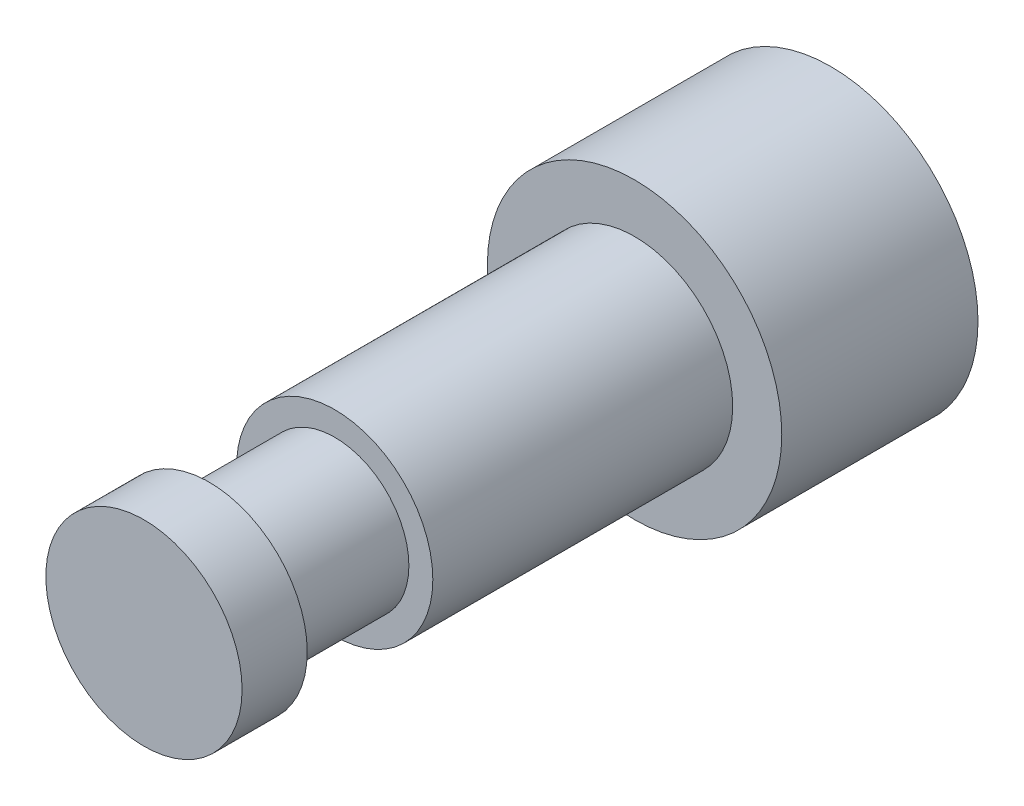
ISO-10303-21;
HEADER;
FILE_DESCRIPTION(('STEP AP214'),'2;1');
FILE_NAME('part.step','',(''),(''),'','','');
FILE_SCHEMA(('AUTOMOTIVE_DESIGN { 1 0 10303 214 1 1 1 1 }'));
ENDSEC;
DATA;
#1=APPLICATION_CONTEXT('core data for automotive mechanical design processes');
#2=APPLICATION_PROTOCOL_DEFINITION('international standard','automotive_design',2000,#1);
#3=PRODUCT_CONTEXT('',#1,'mechanical');
#4=PRODUCT('Part','Part','',(#3));
#5=PRODUCT_RELATED_PRODUCT_CATEGORY('part','',(#4));
#6=PRODUCT_DEFINITION_FORMATION('','',#4);
#7=PRODUCT_DEFINITION_CONTEXT('part definition',#1,'design');
#8=PRODUCT_DEFINITION('design','',#6,#7);
#9=PRODUCT_DEFINITION_SHAPE('','',#8);
#10=(LENGTH_UNIT() NAMED_UNIT(*) SI_UNIT(.MILLI.,.METRE.));
#11=(NAMED_UNIT(*) PLANE_ANGLE_UNIT() SI_UNIT($,.RADIAN.));
#12=(NAMED_UNIT(*) SI_UNIT($,.STERADIAN.) SOLID_ANGLE_UNIT());
#13=UNCERTAINTY_MEASURE_WITH_UNIT(LENGTH_MEASURE(1.E-05),#10,'distance_accuracy_value','');
#14=(GEOMETRIC_REPRESENTATION_CONTEXT(3) GLOBAL_UNCERTAINTY_ASSIGNED_CONTEXT((#13)) GLOBAL_UNIT_ASSIGNED_CONTEXT((#10,
#11,#12)) REPRESENTATION_CONTEXT('',''));
#15=CARTESIAN_POINT('',(0.,0.,0.));
#16=DIRECTION('',(0.,0.,1.));
#17=DIRECTION('',(1.,0.,0.));
#18=AXIS2_PLACEMENT_3D('',#15,#16,#17);
#19=CARTESIAN_POINT('',(0.,0.,6.35));
#20=DIRECTION('',(0.,0.,-1.));
#21=DIRECTION('',(-1.,0.,0.));
#22=AXIS2_PLACEMENT_3D('',#19,#20,#21);
#23=CYLINDRICAL_SURFACE('',#22,4.7625);
#24=CARTESIAN_POINT('',(0.,0.,6.35));
#25=DIRECTION('',(0.,0.,1.));
#26=DIRECTION('',(1.,0.,0.));
#27=AXIS2_PLACEMENT_3D('',#24,#25,#26);
#28=CIRCLE('',#27,4.7625);
#29=CARTESIAN_POINT('',(4.7625,0.,6.35));
#30=VERTEX_POINT('',#29);
#31=EDGE_CURVE('E29',#30,#30,#28,.T.);
#32=ORIENTED_EDGE('',*,*,#31,.F.);
#33=EDGE_LOOP('',(#32));
#34=FACE_BOUND('',#33,.T.);
#35=CARTESIAN_POINT('',(0.,0.,0.));
#36=DIRECTION('',(0.,0.,1.));
#37=DIRECTION('',(1.,0.,0.));
#38=AXIS2_PLACEMENT_3D('',#35,#36,#37);
#39=CIRCLE('',#38,4.7625);
#40=CARTESIAN_POINT('',(4.7625,0.,0.));
#41=VERTEX_POINT('',#40);
#42=EDGE_CURVE('E48',#41,#41,#39,.T.);
#43=ORIENTED_EDGE('',*,*,#42,.T.);
#44=EDGE_LOOP('',(#43));
#45=FACE_BOUND('',#44,.T.);
#46=ADVANCED_FACE('F26',(#34,#45),#23,.T.);
#47=CARTESIAN_POINT('',(0.,0.,6.35));
#48=DIRECTION('',(0.,0.,1.));
#49=DIRECTION('',(1.,0.,0.));
#50=AXIS2_PLACEMENT_3D('',#47,#48,#49);
#51=PLANE('',#50);
#52=CARTESIAN_POINT('',(0.,0.,6.35));
#53=DIRECTION('',(0.,0.,1.));
#54=DIRECTION('',(1.,0.,0.));
#55=AXIS2_PLACEMENT_3D('',#52,#53,#54);
#56=CIRCLE('',#55,3.175);
#57=CARTESIAN_POINT('',(3.175,0.,6.35));
#58=VERTEX_POINT('',#57);
#59=EDGE_CURVE('E33',#58,#58,#56,.T.);
#60=ORIENTED_EDGE('',*,*,#59,.F.);
#61=EDGE_LOOP('',(#60));
#62=FACE_BOUND('',#61,.T.);
#63=ORIENTED_EDGE('',*,*,#31,.T.);
#64=EDGE_LOOP('',(#63));
#65=FACE_BOUND('',#64,.T.);
#66=ADVANCED_FACE('F55',(#62,#65),#51,.T.);
#67=CARTESIAN_POINT('',(0.,0.,0.));
#68=DIRECTION('',(0.,0.,1.));
#69=DIRECTION('',(1.,0.,0.));
#70=AXIS2_PLACEMENT_3D('',#67,#68,#69);
#71=PLANE('',#70);
#72=ORIENTED_EDGE('',*,*,#42,.F.);
#73=EDGE_LOOP('',(#72));
#74=FACE_BOUND('',#73,.T.);
#75=ADVANCED_FACE('F61',(#74),#71,.F.);
#76=CARTESIAN_POINT('',(0.,0.,16.0528));
#77=DIRECTION('',(0.,0.,-1.));
#78=DIRECTION('',(-1.,0.,0.));
#79=AXIS2_PLACEMENT_3D('',#76,#77,#78);
#80=CYLINDRICAL_SURFACE('',#79,3.175);
#81=CARTESIAN_POINT('',(0.,0.,16.0528));
#82=DIRECTION('',(0.,0.,1.));
#83=DIRECTION('',(1.,0.,0.));
#84=AXIS2_PLACEMENT_3D('',#81,#82,#83);
#85=CIRCLE('',#84,3.175);
#86=CARTESIAN_POINT('',(3.175,0.,16.0528));
#87=VERTEX_POINT('',#86);
#88=EDGE_CURVE('E45',#87,#87,#85,.T.);
#89=ORIENTED_EDGE('',*,*,#88,.F.);
#90=EDGE_LOOP('',(#89));
#91=FACE_BOUND('',#90,.T.);
#92=ORIENTED_EDGE('',*,*,#59,.T.);
#93=EDGE_LOOP('',(#92));
#94=FACE_BOUND('',#93,.T.);
#95=ADVANCED_FACE('F66',(#91,#94),#80,.T.);
#96=CARTESIAN_POINT('',(0.,0.,16.0528));
#97=DIRECTION('',(0.,0.,1.));
#98=DIRECTION('',(1.,0.,0.));
#99=AXIS2_PLACEMENT_3D('',#96,#97,#98);
#100=PLANE('',#99);
#101=CARTESIAN_POINT('',(0.,0.,16.0528));
#102=DIRECTION('',(0.,0.,1.));
#103=DIRECTION('',(1.,0.,0.));
#104=AXIS2_PLACEMENT_3D('',#101,#102,#103);
#105=CIRCLE('',#104,2.4003);
#106=CARTESIAN_POINT('',(2.4003,0.,16.0528));
#107=VERTEX_POINT('',#106);
#108=EDGE_CURVE('E10',#107,#107,#105,.T.);
#109=ORIENTED_EDGE('',*,*,#108,.F.);
#110=EDGE_LOOP('',(#109));
#111=FACE_BOUND('',#110,.T.);
#112=ORIENTED_EDGE('',*,*,#88,.T.);
#113=EDGE_LOOP('',(#112));
#114=FACE_BOUND('',#113,.T.);
#115=ADVANCED_FACE('F73',(#111,#114),#100,.T.);
#116=CARTESIAN_POINT('',(0.,0.,20.1168));
#117=DIRECTION('',(0.,0.,-1.));
#118=DIRECTION('',(-1.,0.,0.));
#119=AXIS2_PLACEMENT_3D('',#116,#117,#118);
#120=CYLINDRICAL_SURFACE('',#119,2.4003);
#121=CARTESIAN_POINT('',(0.,0.,20.1168));
#122=DIRECTION('',(0.,0.,1.));
#123=DIRECTION('',(1.,0.,0.));
#124=AXIS2_PLACEMENT_3D('',#121,#122,#123);
#125=CIRCLE('',#124,2.4003);
#126=CARTESIAN_POINT('',(2.4003,0.,20.1168));
#127=VERTEX_POINT('',#126);
#128=EDGE_CURVE('E43',#127,#127,#125,.T.);
#129=ORIENTED_EDGE('',*,*,#128,.F.);
#130=EDGE_LOOP('',(#129));
#131=FACE_BOUND('',#130,.T.);
#132=ORIENTED_EDGE('',*,*,#108,.T.);
#133=EDGE_LOOP('',(#132));
#134=FACE_BOUND('',#133,.T.);
#135=ADVANCED_FACE('F77',(#131,#134),#120,.T.);
#136=CARTESIAN_POINT('',(0.,0.,20.1168));
#137=DIRECTION('',(0.,0.,1.));
#138=DIRECTION('',(1.,0.,0.));
#139=AXIS2_PLACEMENT_3D('',#136,#137,#138);
#140=PLANE('',#139);
#141=CARTESIAN_POINT('',(0.,0.,20.1168));
#142=DIRECTION('',(0.,0.,1.));
#143=DIRECTION('',(1.,0.,0.));
#144=AXIS2_PLACEMENT_3D('',#141,#142,#143);
#145=CIRCLE('',#144,3.175);
#146=CARTESIAN_POINT('',(3.175,0.,20.1168));
#147=VERTEX_POINT('',#146);
#148=EDGE_CURVE('E98',#147,#147,#145,.T.);
#149=ORIENTED_EDGE('',*,*,#148,.F.);
#150=EDGE_LOOP('',(#149));
#151=FACE_BOUND('',#150,.T.);
#152=ORIENTED_EDGE('',*,*,#128,.T.);
#153=EDGE_LOOP('',(#152));
#154=FACE_BOUND('',#153,.T.);
#155=ADVANCED_FACE('F81',(#151,#154),#140,.F.);
#156=CARTESIAN_POINT('',(0.,0.,22.225));
#157=DIRECTION('',(0.,0.,-1.));
#158=DIRECTION('',(-1.,0.,0.));
#159=AXIS2_PLACEMENT_3D('',#156,#157,#158);
#160=CYLINDRICAL_SURFACE('',#159,3.175);
#161=CARTESIAN_POINT('',(0.,0.,22.225));
#162=DIRECTION('',(0.,0.,1.));
#163=DIRECTION('',(1.,0.,0.));
#164=AXIS2_PLACEMENT_3D('',#161,#162,#163);
#165=CIRCLE('',#164,3.175);
#166=CARTESIAN_POINT('',(3.175,0.,22.225));
#167=VERTEX_POINT('',#166);
#168=EDGE_CURVE('E41',#167,#167,#165,.T.);
#169=ORIENTED_EDGE('',*,*,#168,.F.);
#170=EDGE_LOOP('',(#169));
#171=FACE_BOUND('',#170,.T.);
#172=ORIENTED_EDGE('',*,*,#148,.T.);
#173=EDGE_LOOP('',(#172));
#174=FACE_BOUND('',#173,.T.);
#175=ADVANCED_FACE('F83',(#171,#174),#160,.T.);
#176=CARTESIAN_POINT('',(0.,0.,22.225));
#177=DIRECTION('',(0.,0.,1.));
#178=DIRECTION('',(1.,0.,0.));
#179=AXIS2_PLACEMENT_3D('',#176,#177,#178);
#180=PLANE('',#179);
#181=ORIENTED_EDGE('',*,*,#168,.T.);
#182=EDGE_LOOP('',(#181));
#183=FACE_BOUND('',#182,.T.);
#184=ADVANCED_FACE('F86',(#183),#180,.T.);
#185=CLOSED_SHELL('',(#46,#66,#75,#95,#115,#135,#155,#175,#184));
#186=MANIFOLD_SOLID_BREP('B2',#185);
#187=ADVANCED_BREP_SHAPE_REPRESENTATION('',(#18,#186),#14);
#188=SHAPE_DEFINITION_REPRESENTATION(#9,#187);
ENDSEC;
END-ISO-10303-21;
